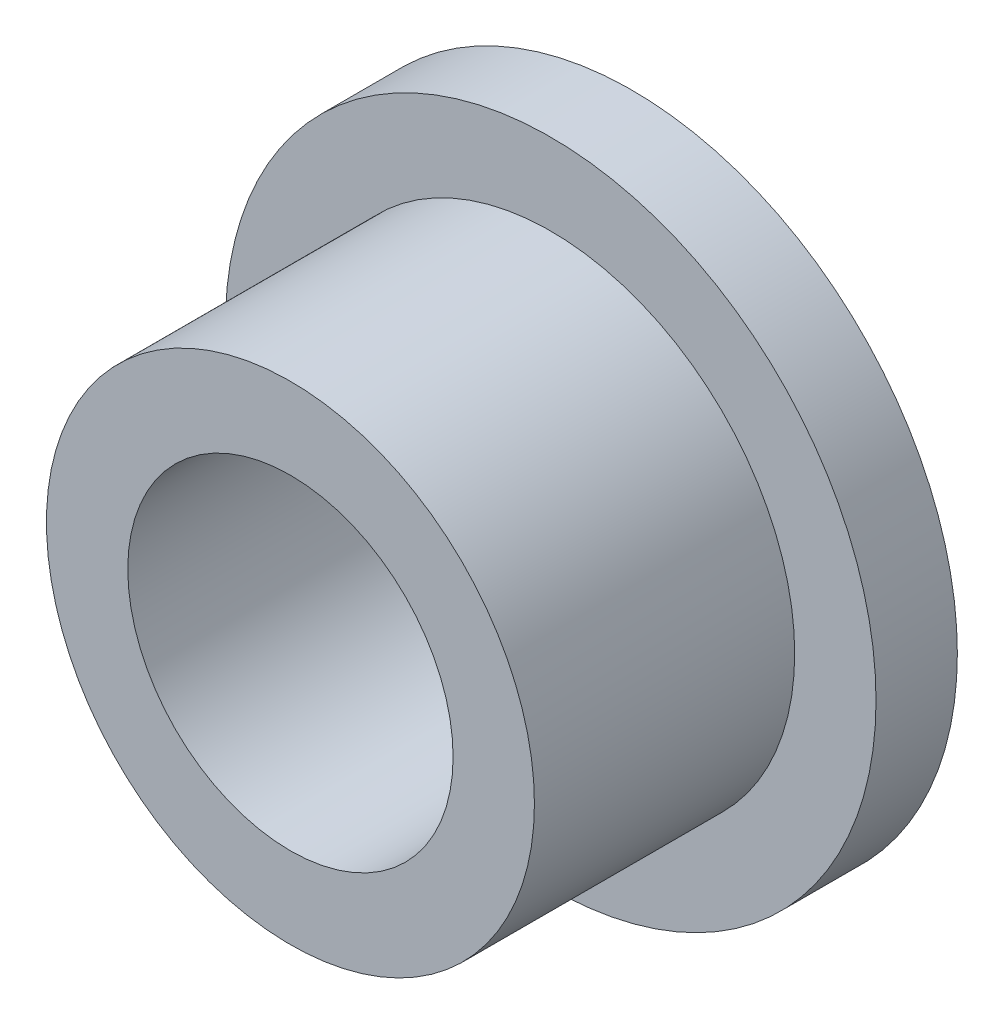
from build123d import *

# Parameters (mm, degrees)
SKETCH1_R           = 6.35
BOSS_EXTRUDE1_DEPTH = 1.5875
SKETCH2_R           = 4.7625
BOSS_EXTRUDE2_DEPTH = 5.08
SKETCH3_R           = 3.175
CUT_EXTRUDE1_DEPTH  = 12.184835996


with BuildPart() as part:
    # Sketch1 → Boss-Extrude1 (new body)
    with BuildSketch(Plane.XY):
        Circle(SKETCH1_R)
    extrude(amount=BOSS_EXTRUDE1_DEPTH)

    # Sketch2 → Boss-Extrude2 (add)
    with BuildSketch(Plane.XY.offset(1.5875)):
        Circle(SKETCH2_R)
    extrude(amount=BOSS_EXTRUDE2_DEPTH)

    # Sketch3 → Cut-Extrude1 (cut, through all)
    with BuildSketch(Plane.XY.offset(6.6675)):
        Circle(SKETCH3_R)
    extrude(amount=-CUT_EXTRUDE1_DEPTH, mode=Mode.SUBTRACT)


solid = part.part
